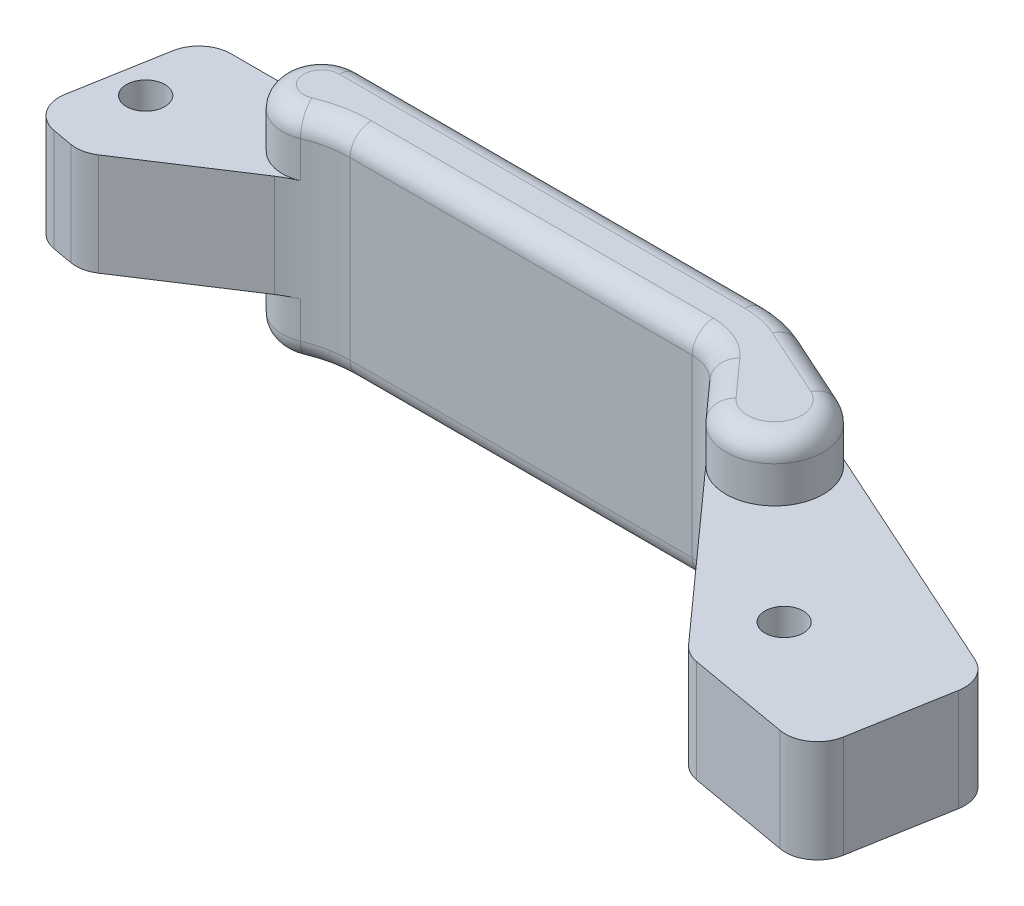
from build123d import *

# Parameters (mm, degrees)
SKETCH1_R             = 1.143
BOSS_EXTRUDE1_DEPTH   = 3.048
BOSS_EXTRUDE2_DEPTH   = 6.4897
FILLET1_R             = 1.905
FILLET2_R             = 1.27
BODY_MOVE_COPY1_ANGLE = 90.435230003


with BuildPart() as part:
    # Sketch1 → Boss-Extrude1 (new, symmetric)
    with BuildSketch(Plane.XY):
        with BuildLine():
            Line((-25.4381, -4.410332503), (-25.4381, 4.619570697))
            Line((-25.4381, 4.619570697), (-21.562695, 4.619570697))
            Line((-21.562695, 4.619570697), (-15.503881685, -1.064192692))
            ThreePointArc((-15.503881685, -1.064192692), (-14.0011957, -2.111622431), (-12.262046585, -2.6865438))
            Line((-12.262046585, -2.6865438), (7.787279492, -6.221780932))
            ThreePointArc((7.787279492, -6.221780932), (8.846486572, -6.184005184), (9.798063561, -5.717263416))
            Line((9.798063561, -5.717263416), (23.016653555, 4.6736))
            Line((23.016653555, 4.6736), (31.711911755, 4.6736))
            Line((31.711911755, 4.6736), (31.711911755, -4.6407578))
            Line((31.711911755, -4.6407578), (10.175343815, -10.119886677))
            ThreePointArc((10.175343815, -10.119886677), (8.846486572, -10.311505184), (7.507044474, -10.219450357))
            Line((7.507044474, -10.219450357), (-25.4381, -4.410332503))
        make_face()
        with Locations(Location((-23.4188, 0, 0), (0, 0, 180))):
            Circle(SKETCH1_R, mode=Mode.SUBTRACT)
        with Locations(Location((23.4188, 0, 0), (0, 0, 180))):
            Circle(SKETCH1_R, mode=Mode.SUBTRACT)
    extrude(amount=BOSS_EXTRUDE1_DEPTH, both=True)

    # Sketch2 → Boss-Extrude2 (add, symmetric)
    with BuildSketch(Plane.XY):
        with BuildLine():
            Line((-12.262046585, -2.6865438), (7.787279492, -6.221780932))
            ThreePointArc((7.787279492, -6.221780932), (8.846486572, -6.184005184), (9.798063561, -5.717263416))
            Line((9.798063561, -5.717263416), (12.1012299, -3.906791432))
            ThreePointArc((12.1012299, -3.906791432), (16.491055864, -4.904451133), (14.606199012, -8.99263062))
            Line((14.606199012, -8.99263062), (10.175343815, -10.119886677))
            ThreePointArc((10.175343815, -10.119886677), (8.846486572, -10.311505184), (7.507044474, -10.219450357))
            Line((7.507044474, -10.219450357), (-16.256366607, -6.02931983))
            ThreePointArc((-16.256366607, -6.02931983), (-18.021470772, -2.886324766), (-14.592315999, -1.775060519))
            ThreePointArc((-14.592315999, -1.775060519), (-13.472521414, -2.346717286), (-12.262046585, -2.6865438))
        make_face()
    extrude(amount=BOSS_EXTRUDE2_DEPTH, both=True)

    # Fillet1
    fillet1_edges = [part.edges().sort_by_distance(p)[0] for p in [
        (-25.4381, -4.410332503, 0),
        (-25.4381, 4.619570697, 0),
        (-21.562695, 4.619570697, 0),
        (23.016653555, 4.6736, 0),
        (31.711911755, 4.6736, 0),
        (31.711911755, -4.6407578, 0),
    ]]
    fillet(fillet1_edges, radius=FILLET1_R)

    # Fillet2
    fillet2_edges = [part.edges().sort_by_distance(p)[0] for p in [
        (-4.374661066, -8.124385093, -6.4897),
        (12.390771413, -9.556258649, -6.4897),
        (8.846486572, -10.311505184, -6.4897),
        (16.491055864, -4.904451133, -6.4897),
        (10.94964673, -4.812027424, -6.4897),
        (-13.472521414, -2.346717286, -6.4897),
        (8.846486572, -6.184005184, -6.4897),
        (-18.021470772, -2.886324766, -6.4897),
        (-2.237383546, -4.454162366, -6.4897),
        (-13.472521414, -2.346717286, 6.4897),
        (-18.021470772, -2.886324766, 6.4897),
        (-4.374661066, -8.124385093, 6.4897),
        (8.846486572, -10.311505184, 6.4897),
        (12.390771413, -9.556258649, 6.4897),
        (16.491055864, -4.904451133, 6.4897),
        (10.94964673, -4.812027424, 6.4897),
        (8.846486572, -6.184005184, 6.4897),
        (-2.237383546, -4.454162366, 6.4897),
    ]]
    fillet(fillet2_edges, radius=FILLET2_R)


with BuildPart() as part_1:
    # Body-Move_Copy1: moved
    add(part.part.moved(Location((0, 0, 0))).rotate(Axis((-0.19580072, -2.529586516, -0.291574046), (0.9924325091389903, -0.08682659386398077, 0.08682659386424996)), BODY_MOVE_COPY1_ANGLE))


solid = part_1.part
